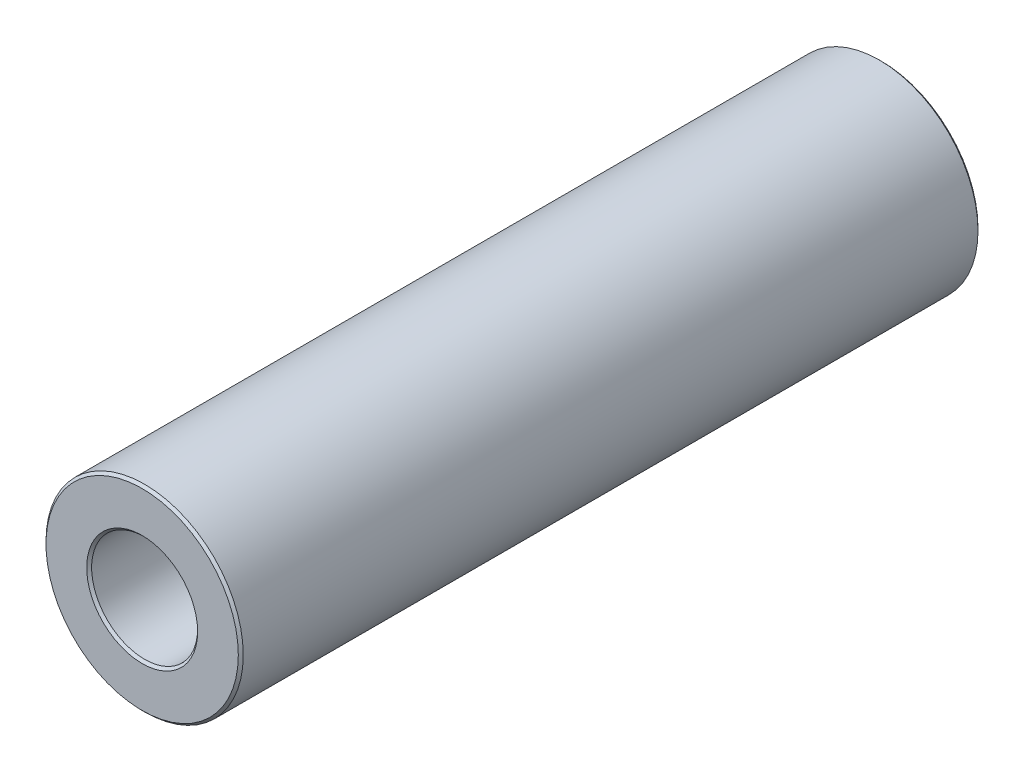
ISO-10303-21;
HEADER;
FILE_DESCRIPTION(('STEP AP214'),'2;1');
FILE_NAME('part.step','',(''),(''),'','','');
FILE_SCHEMA(('AUTOMOTIVE_DESIGN { 1 0 10303 214 1 1 1 1 }'));
ENDSEC;
DATA;
#1=APPLICATION_CONTEXT('core data for automotive mechanical design processes');
#2=APPLICATION_PROTOCOL_DEFINITION('international standard','automotive_design',2000,#1);
#3=PRODUCT_CONTEXT('',#1,'mechanical');
#4=PRODUCT('Part','Part','',(#3));
#5=PRODUCT_RELATED_PRODUCT_CATEGORY('part','',(#4));
#6=PRODUCT_DEFINITION_FORMATION('','',#4);
#7=PRODUCT_DEFINITION_CONTEXT('part definition',#1,'design');
#8=PRODUCT_DEFINITION('design','',#6,#7);
#9=PRODUCT_DEFINITION_SHAPE('','',#8);
#10=(LENGTH_UNIT() NAMED_UNIT(*) SI_UNIT(.MILLI.,.METRE.));
#11=(NAMED_UNIT(*) PLANE_ANGLE_UNIT() SI_UNIT($,.RADIAN.));
#12=(NAMED_UNIT(*) SI_UNIT($,.STERADIAN.) SOLID_ANGLE_UNIT());
#13=UNCERTAINTY_MEASURE_WITH_UNIT(LENGTH_MEASURE(1.E-05),#10,'distance_accuracy_value','');
#14=(GEOMETRIC_REPRESENTATION_CONTEXT(3) GLOBAL_UNCERTAINTY_ASSIGNED_CONTEXT((#13)) GLOBAL_UNIT_ASSIGNED_CONTEXT((#10,
#11,#12)) REPRESENTATION_CONTEXT('',''));
#15=CARTESIAN_POINT('',(0.,0.,0.));
#16=DIRECTION('',(0.,0.,1.));
#17=DIRECTION('',(1.,0.,0.));
#18=AXIS2_PLACEMENT_3D('',#15,#16,#17);
#19=CARTESIAN_POINT('',(0.,0.,15.));
#20=DIRECTION('',(0.,0.,1.));
#21=DIRECTION('',(1.,0.,0.));
#22=AXIS2_PLACEMENT_3D('',#19,#20,#21);
#23=PLANE('',#22);
#24=CARTESIAN_POINT('',(0.,0.,15.));
#25=DIRECTION('',(0.,0.,1.));
#26=DIRECTION('',(1.,0.,0.));
#27=AXIS2_PLACEMENT_3D('',#24,#25,#26);
#28=CIRCLE('',#27,2.25);
#29=CARTESIAN_POINT('',(2.25,0.,15.));
#30=VERTEX_POINT('',#29);
#31=EDGE_CURVE('E10',#30,#30,#28,.F.);
#32=ORIENTED_EDGE('',*,*,#31,.T.);
#33=EDGE_LOOP('',(#32));
#34=FACE_BOUND('',#33,.T.);
#35=CARTESIAN_POINT('',(0.,0.,15.));
#36=DIRECTION('',(0.,0.,1.));
#37=DIRECTION('',(1.,0.,0.));
#38=AXIS2_PLACEMENT_3D('',#35,#36,#37);
#39=CIRCLE('',#38,3.9);
#40=CARTESIAN_POINT('',(3.9,0.,15.));
#41=VERTEX_POINT('',#40);
#42=EDGE_CURVE('E45',#41,#41,#39,.T.);
#43=ORIENTED_EDGE('',*,*,#42,.T.);
#44=EDGE_LOOP('',(#43));
#45=FACE_BOUND('',#44,.T.);
#46=ADVANCED_FACE('F37',(#34,#45),#23,.T.);
#47=CARTESIAN_POINT('',(0.,0.,-15.));
#48=DIRECTION('',(0.,0.,1.));
#49=DIRECTION('',(1.,0.,0.));
#50=AXIS2_PLACEMENT_3D('',#47,#48,#49);
#51=PLANE('',#50);
#52=CARTESIAN_POINT('',(0.,0.,-15.));
#53=DIRECTION('',(0.,0.,1.));
#54=DIRECTION('',(1.,0.,0.));
#55=AXIS2_PLACEMENT_3D('',#52,#53,#54);
#56=CIRCLE('',#55,3.9);
#57=CARTESIAN_POINT('',(3.9,0.,-15.));
#58=VERTEX_POINT('',#57);
#59=EDGE_CURVE('E62',#58,#58,#56,.F.);
#60=ORIENTED_EDGE('',*,*,#59,.T.);
#61=EDGE_LOOP('',(#60));
#62=FACE_BOUND('',#61,.T.);
#63=CARTESIAN_POINT('',(0.,0.,-15.));
#64=DIRECTION('',(0.,0.,1.));
#65=DIRECTION('',(1.,0.,0.));
#66=AXIS2_PLACEMENT_3D('',#63,#64,#65);
#67=CIRCLE('',#66,2.25);
#68=CARTESIAN_POINT('',(2.25,0.,-15.));
#69=VERTEX_POINT('',#68);
#70=EDGE_CURVE('E66',#69,#69,#67,.T.);
#71=ORIENTED_EDGE('',*,*,#70,.T.);
#72=EDGE_LOOP('',(#71));
#73=FACE_BOUND('',#72,.T.);
#74=ADVANCED_FACE('F89',(#62,#73),#51,.F.);
#75=CARTESIAN_POINT('',(0.,0.,15.));
#76=DIRECTION('',(0.,0.,-1.));
#77=DIRECTION('',(-1.,0.,0.));
#78=AXIS2_PLACEMENT_3D('',#75,#76,#77);
#79=CYLINDRICAL_SURFACE('',#78,4.);
#80=CARTESIAN_POINT('',(0.,0.,-14.9));
#81=DIRECTION('',(0.,0.,1.));
#82=DIRECTION('',(1.,0.,0.));
#83=AXIS2_PLACEMENT_3D('',#80,#81,#82);
#84=CIRCLE('',#83,4.);
#85=CARTESIAN_POINT('',(4.,0.,-14.9));
#86=VERTEX_POINT('',#85);
#87=EDGE_CURVE('E70',#86,#86,#84,.T.);
#88=ORIENTED_EDGE('',*,*,#87,.T.);
#89=EDGE_LOOP('',(#88));
#90=FACE_BOUND('',#89,.T.);
#91=CARTESIAN_POINT('',(0.,0.,14.9));
#92=DIRECTION('',(0.,0.,1.));
#93=DIRECTION('',(1.,0.,0.));
#94=AXIS2_PLACEMENT_3D('',#91,#92,#93);
#95=CIRCLE('',#94,4.);
#96=CARTESIAN_POINT('',(4.,0.,14.9));
#97=VERTEX_POINT('',#96);
#98=EDGE_CURVE('E74',#97,#97,#95,.F.);
#99=ORIENTED_EDGE('',*,*,#98,.T.);
#100=EDGE_LOOP('',(#99));
#101=FACE_BOUND('',#100,.T.);
#102=ADVANCED_FACE('F78',(#90,#101),#79,.T.);
#103=CARTESIAN_POINT('',(0.,0.,15.));
#104=DIRECTION('',(0.,0.,-1.));
#105=DIRECTION('',(-1.,0.,0.));
#106=AXIS2_PLACEMENT_3D('',#103,#104,#105);
#107=CYLINDRICAL_SURFACE('',#106,2.15);
#108=CARTESIAN_POINT('',(0.,0.,-14.9));
#109=DIRECTION('',(0.,0.,1.));
#110=DIRECTION('',(1.,0.,0.));
#111=AXIS2_PLACEMENT_3D('',#108,#109,#110);
#112=CIRCLE('',#111,2.15);
#113=CARTESIAN_POINT('',(2.15,0.,-14.9));
#114=VERTEX_POINT('',#113);
#115=EDGE_CURVE('E51',#114,#114,#112,.F.);
#116=ORIENTED_EDGE('',*,*,#115,.T.);
#117=EDGE_LOOP('',(#116));
#118=FACE_BOUND('',#117,.T.);
#119=CARTESIAN_POINT('',(0.,0.,14.9));
#120=DIRECTION('',(0.,0.,1.));
#121=DIRECTION('',(1.,0.,0.));
#122=AXIS2_PLACEMENT_3D('',#119,#120,#121);
#123=CIRCLE('',#122,2.15);
#124=CARTESIAN_POINT('',(2.15,0.,14.9));
#125=VERTEX_POINT('',#124);
#126=EDGE_CURVE('E56',#125,#125,#123,.T.);
#127=ORIENTED_EDGE('',*,*,#126,.T.);
#128=EDGE_LOOP('',(#127));
#129=FACE_BOUND('',#128,.T.);
#130=ADVANCED_FACE('F97',(#118,#129),#107,.F.);
#131=CARTESIAN_POINT('',(0.,0.,-14.9));
#132=DIRECTION('',(0.,0.,1.));
#133=DIRECTION('',(1.,0.,0.));
#134=AXIS2_PLACEMENT_3D('',#131,#132,#133);
#135=CONICAL_SURFACE('',#134,4.,0.785398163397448);
#136=ORIENTED_EDGE('',*,*,#59,.F.);
#137=EDGE_LOOP('',(#136));
#138=FACE_BOUND('',#137,.T.);
#139=ORIENTED_EDGE('',*,*,#87,.F.);
#140=EDGE_LOOP('',(#139));
#141=FACE_BOUND('',#140,.T.);
#142=ADVANCED_FACE('F102',(#138,#141),#135,.T.);
#143=CARTESIAN_POINT('',(0.,0.,-15.));
#144=DIRECTION('',(0.,0.,-1.));
#145=DIRECTION('',(-1.,0.,0.));
#146=AXIS2_PLACEMENT_3D('',#143,#144,#145);
#147=CONICAL_SURFACE('',#146,2.25,0.785398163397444);
#148=ORIENTED_EDGE('',*,*,#115,.F.);
#149=EDGE_LOOP('',(#148));
#150=FACE_BOUND('',#149,.T.);
#151=ORIENTED_EDGE('',*,*,#70,.F.);
#152=EDGE_LOOP('',(#151));
#153=FACE_BOUND('',#152,.T.);
#154=ADVANCED_FACE('F86',(#150,#153),#147,.F.);
#155=CARTESIAN_POINT('',(0.,0.,14.9));
#156=DIRECTION('',(0.,0.,1.));
#157=DIRECTION('',(1.,0.,0.));
#158=AXIS2_PLACEMENT_3D('',#155,#156,#157);
#159=CONICAL_SURFACE('',#158,2.15,0.785398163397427);
#160=ORIENTED_EDGE('',*,*,#31,.F.);
#161=EDGE_LOOP('',(#160));
#162=FACE_BOUND('',#161,.T.);
#163=ORIENTED_EDGE('',*,*,#126,.F.);
#164=EDGE_LOOP('',(#163));
#165=FACE_BOUND('',#164,.T.);
#166=ADVANCED_FACE('F82',(#162,#165),#159,.F.);
#167=CARTESIAN_POINT('',(0.,0.,15.));
#168=DIRECTION('',(0.,0.,-1.));
#169=DIRECTION('',(-1.,0.,0.));
#170=AXIS2_PLACEMENT_3D('',#167,#168,#169);
#171=CONICAL_SURFACE('',#170,3.9,0.785398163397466);
#172=ORIENTED_EDGE('',*,*,#98,.F.);
#173=EDGE_LOOP('',(#172));
#174=FACE_BOUND('',#173,.T.);
#175=ORIENTED_EDGE('',*,*,#42,.F.);
#176=EDGE_LOOP('',(#175));
#177=FACE_BOUND('',#176,.T.);
#178=ADVANCED_FACE('F39',(#174,#177),#171,.T.);
#179=CLOSED_SHELL('',(#46,#74,#102,#130,#142,#154,#166,#178));
#180=MANIFOLD_SOLID_BREP('B2',#179);
#181=ADVANCED_BREP_SHAPE_REPRESENTATION('',(#18,#180),#14);
#182=SHAPE_DEFINITION_REPRESENTATION(#9,#181);
ENDSEC;
END-ISO-10303-21;
